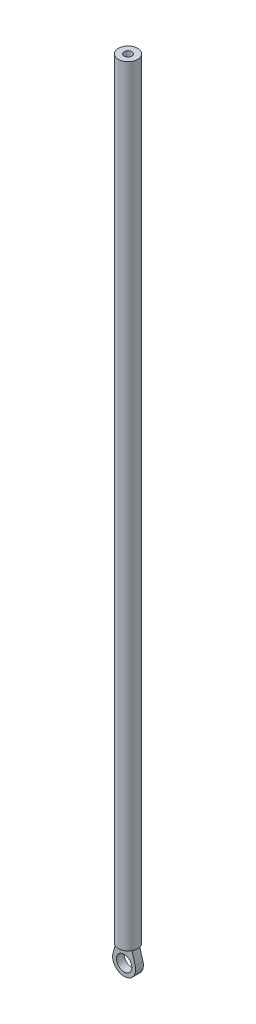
from build123d import *

# Parameters (mm, degrees)
SKETCH1_R           = 15
SKETCH1_R_2         = 10
BOSS_EXTRUDE1_DEPTH = 5
SKETCH2_R           = 12.5
BOSS_EXTRUDE3_DEPTH = 1000
CUT_EXTRUDE1_START  = 200
SKETCH2_3_R         = 5
CUT_EXTRUDE1_DEPTH  = 1000


with BuildPart() as part:
    # Sketch1 → Boss-Extrude1 (new, symmetric)
    # profile 1 of 2: a face of its own
    with BuildSketch(Plane.XY):
        with BuildLine():
            Line((10, 20), (-10, 20))
            Line((-10, 20), (-14.449874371, 4.025062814))
            ThreePointArc((-14.449874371, 4.025062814), (0, 15), (14.449874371, 4.025062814))
            Line((14.449874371, 4.025062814), (10, 20))
        make_face()
    # profile 2 of 2: a face of its own
    with BuildSketch(Plane.XY):
        Circle(SKETCH1_R)
        Circle(SKETCH1_R_2, mode=Mode.SUBTRACT)
    extrude(amount=BOSS_EXTRUDE1_DEPTH, both=True)

    # Sketch2 → Boss-Extrude3 (add)
    with BuildSketch(Plane(origin=(0, 20, 0), x_dir=(1, 0, 0), z_dir=(0, 1, 0))):
        with Locations(Location((0, 0, 0), (0, 0, 270))):
            Circle(SKETCH2_R)
    extrude(amount=BOSS_EXTRUDE3_DEPTH)

    # Sketch2_3 → Cut-Extrude1 (cut)
    with BuildSketch(Plane(origin=(0, 20, 0), x_dir=(1, 0, 0), z_dir=(0, 1, 0)).offset(CUT_EXTRUDE1_START)):
        with Locations(Location((0, 0, 0), (0, 0, 270))):
            Circle(SKETCH2_3_R)
    extrude(amount=CUT_EXTRUDE1_DEPTH, mode=Mode.SUBTRACT)


solid = part.part
